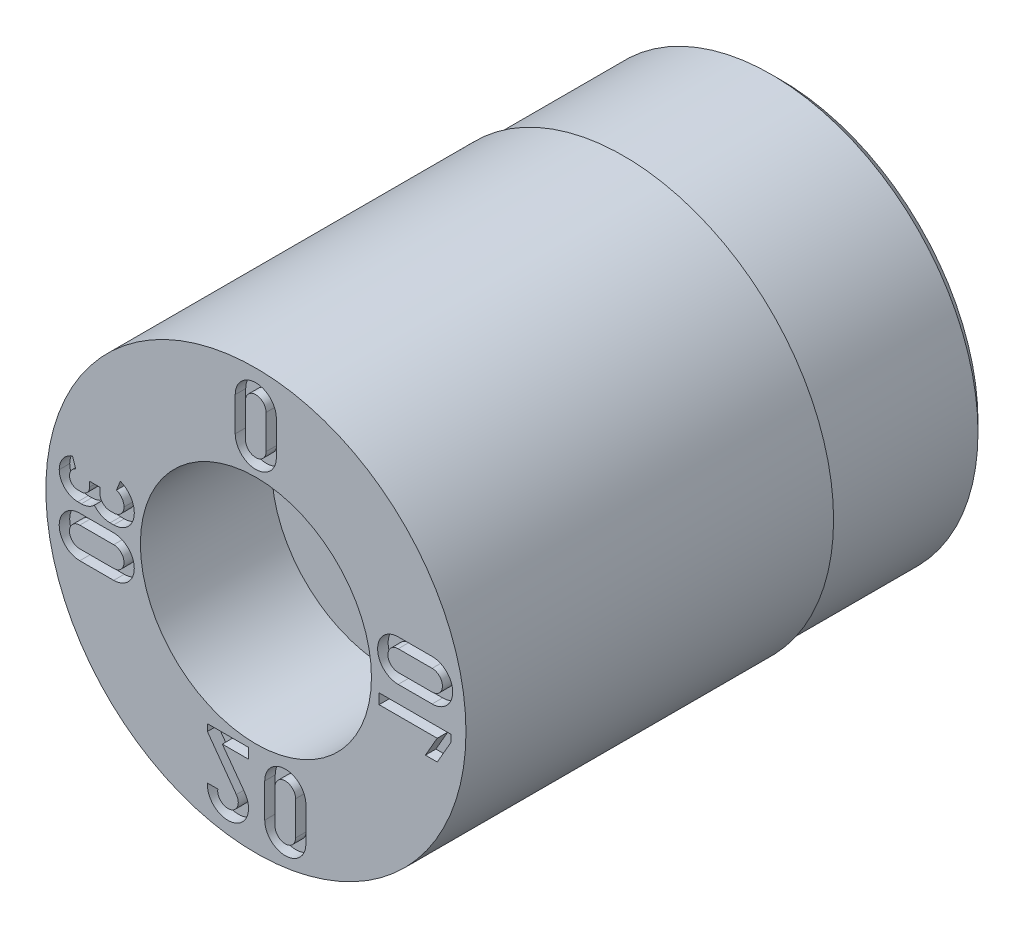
from build123d import *

# Parameters (mm, degrees)
SKETCH4_W          = 3
SKETCH4_H          = 1
CUT_EXTRUDE1_DEPTH = 0.2


with BuildPart() as part:
    # Sketch1 → Revolve1 (revolve)
    with BuildSketch(Plane(origin=(0, 0, 0), x_dir=(0, 0, -1), z_dir=(1, 0, 0)), mode=Mode.PRIVATE) as revolve1_sk:
        Polygon((0, 4), (0, 2.2), (2.5, 2.2), (2.5, 1.15), (10, 1.15), (10, 3.75), (9.75, 4), align=None)
    revolve(revolve1_sk.sketch.rotate(Axis((0, 0, 3.797909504), (0, 0, -1)), 90), axis=Axis((0, 0, 3.797909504), (0, 0, -1)))

    # Sketch4 → Cut-Revolve1 (revolve, cut)
    with BuildSketch(Plane(origin=(0, 0, 0), x_dir=(0, 0, -1), z_dir=(1, 0, 0)), mode=Mode.PRIVATE) as cut_revolve1_sk:
        with Locations((8.5, 4.435)):
            Rectangle(SKETCH4_W, SKETCH4_H)
    revolve(cut_revolve1_sk.sketch.rotate(Axis((0, 0, 0), (0, 0, -1)), 90), axis=Axis((0, 0, 0), (0, 0, -1)), mode=Mode.SUBTRACT)

    # Sketch2 → Cut-Extrude1 (cut)
    # profile 1 of 7: a face of its own
    with BuildSketch(Plane.XY):
        with BuildLine():
            Line((0.951558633, -3.371128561), (0.951613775, -2.724884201))
            ThreePointArc((0.951613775, -2.724884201), (0.559807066, -2.33310244), (0.168043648, -2.724927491))
            Line((0.168043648, -2.724927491), (0.168098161, -3.371194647))
            ThreePointArc((0.168098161, -3.371194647), (0.55986144, -3.76289184), (0.951558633, -3.371128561))
        make_face()
        with BuildLine():
            Line((0.363963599, -2.724910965), (0.364018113, -3.371178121))
            ThreePointArc((0.364018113, -3.371178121), (0.559844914, -3.566971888), (0.755638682, -3.371145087))
            Line((0.755638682, -3.371145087), (0.755693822, -2.724864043))
            ThreePointArc((0.755693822, -2.724864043), (0.55980525, -2.529022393), (0.363963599, -2.724910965))
        make_face(mode=Mode.SUBTRACT)
    # profile 2 of 7: a face of its own
    with BuildSketch(Plane.XY):
        with BuildLine():
            Line((-2.707308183, 0.255520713), (-2.775851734, 0.255526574))
            ThreePointArc((-2.775851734, 0.255526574), (-2.914289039, 0.312882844), (-2.971621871, 0.451329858))
            Line((-2.971621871, 0.451329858), (-2.971613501, 0.549231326))
            Line((-2.971613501, 0.549231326), (-3.167478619, 0.549248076))
            Line((-3.167478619, 0.549248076), (-3.16748699, 0.451370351))
            ThreePointArc((-3.16748699, 0.451370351), (-3.213380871, 0.340599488), (-3.324159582, 0.294724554))
            Line((-3.324159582, 0.294724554), (-3.392693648, 0.294730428))
            ThreePointArc((-3.392693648, 0.294730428), (-3.503425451, 0.340663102), (-3.549347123, 0.451399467))
            ThreePointArc((-3.549347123, 0.451399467), (-3.516330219, 0.55418223), (-3.429520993, 0.618358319))
            Line((-3.429520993, 0.618358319), (-3.49218059, 0.803922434))
            ThreePointArc((-3.49218059, 0.803922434), (-3.675359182, 0.668365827), (-3.745189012, 0.451446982))
            ThreePointArc((-3.745189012, 0.451446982), (-3.641981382, 0.202132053), (-3.392690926, 0.098865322))
            Line((-3.392690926, 0.098865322), (-3.324176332, 0.098859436))
            ThreePointArc((-3.324176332, 0.098859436), (-3.190377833, 0.125238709), (-3.076617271, 0.200448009))
            ThreePointArc((-3.076617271, 0.200448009), (-2.941904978, 0.096587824), (-2.775860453, 0.059661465))
            Line((-2.775860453, 0.059661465), (-2.7072918, 0.059655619))
            ThreePointArc((-2.7072918, 0.059655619), (-2.430353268, 0.174350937), (-2.31564925, 0.451285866))
            ThreePointArc((-2.31564925, 0.451285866), (-2.388596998, 0.688167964), (-2.582149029, 0.842997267))
            Line((-2.582149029, 0.842997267), (-2.654019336, 0.660880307))
            ThreePointArc((-2.654019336, 0.660880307), (-2.550473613, 0.578059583), (-2.511459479, 0.451335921))
            ThreePointArc((-2.511459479, 0.451335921), (-2.568829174, 0.312866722), (-2.707308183, 0.255520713))
        make_face()
    # profile 3 of 7: a face of its own
    with BuildSketch(Plane.XY):
        with BuildLine():
            Line((3.35566898, 0.9217068), (2.709417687, 0.921651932))
            ThreePointArc((2.709417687, 0.921651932), (2.31772071, 0.52989637), (2.70946834, 0.13819146))
            Line((2.70946834, 0.13819146), (3.355735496, 0.138246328))
            ThreePointArc((3.355735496, 0.138246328), (3.747432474, 0.530009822), (3.35566898, 0.9217068))
        make_face()
        with BuildLine():
            Line((2.709451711, 0.334056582), (3.355718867, 0.33411145))
            ThreePointArc((3.355718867, 0.33411145), (3.551567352, 0.529993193), (3.355685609, 0.725841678))
            Line((3.355685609, 0.725841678), (2.709404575, 0.725786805))
            ThreePointArc((2.709404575, 0.725786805), (2.513585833, 0.529898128), (2.709451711, 0.334056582))
        make_face(mode=Mode.SUBTRACT)
    # profile 4 of 7: a face of its own
    with BuildSketch(Plane.XY):
        Polygon((3.716667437, -0.182730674), (3.716678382, -0.311644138), (3.453023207, -0.770238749), (3.227164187, -0.770257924), (3.452277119, -0.378563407), (2.345847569, -0.378657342), (2.345830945, -0.182847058), align=None)
    # profile 5 of 7: a face of its own
    with BuildSketch(Plane.XY):
        with BuildLine():
            Line((-0.140181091, -2.521380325), (-0.140197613, -2.325512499))
            Line((-0.140197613, -2.325512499), (-0.923548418, -2.325578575))
            Line((-0.923548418, -2.325578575), (-0.923537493, -2.455095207))
            Line((-0.923537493, -2.455095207), (-0.372780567, -3.219591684))
            ThreePointArc((-0.372780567, -3.219591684), (-0.485748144, -3.52451017), (-0.725390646, -3.304718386))
            Line((-0.725390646, -3.304718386), (-0.922369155, -3.304739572))
            ThreePointArc((-0.922369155, -3.304739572), (-0.425301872, -3.711013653), (-0.213623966, -3.104938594))
            Line((-0.213623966, -3.104938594), (-0.639603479, -2.521422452))
            Line((-0.639603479, -2.521422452), (-0.140181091, -2.521380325))
        make_face()
    # profile 6 of 7: a face of its own
    with BuildSketch(Plane.XY):
        with BuildLine():
            Line((-0.394003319, 3.364501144), (-0.393948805, 2.718249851))
            ThreePointArc((-0.393948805, 2.718249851), (-0.00225969, 2.326584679), (0.389402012, 2.718277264))
            Line((0.389402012, 2.718277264), (0.389457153, 3.36456723))
            ThreePointArc((0.389457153, 3.36456723), (-0.002306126, 3.756264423), (-0.394003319, 3.364501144))
        make_face()
        with BuildLine():
            Line((0.193591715, 2.718283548), (0.193537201, 3.364550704))
            ThreePointArc((0.193537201, 3.364550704), (-0.0022896, 3.560344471), (-0.198083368, 3.36451767))
            Line((-0.198083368, 3.36451767), (-0.198138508, 2.718236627))
            ThreePointArc((-0.198138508, 2.718236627), (-0.002249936, 2.522394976), (0.193591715, 2.718283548))
        make_face(mode=Mode.SUBTRACT)
    # profile 7 of 7: a face of its own
    with BuildSketch(Plane.XY):
        with BuildLine():
            Line((-3.354033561, -0.071079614), (-2.707782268, -0.071134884))
            ThreePointArc((-2.707782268, -0.071134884), (-2.316077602, -0.46289069), (-2.707833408, -0.854595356))
            Line((-2.707833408, -0.854595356), (-3.354100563, -0.854540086))
            ThreePointArc((-3.354100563, -0.854540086), (-3.745797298, -0.462776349), (-3.354033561, -0.071079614))
        make_face()
        with BuildLine():
            Line((-2.707838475, -0.65878506), (-3.354083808, -0.658620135))
            ThreePointArc((-3.354083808, -0.658620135), (-3.549877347, -0.462793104), (-3.354050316, -0.266999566))
            Line((-3.354050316, -0.266999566), (-2.707769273, -0.266945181))
            ThreePointArc((-2.707769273, -0.266945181), (-2.511887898, -0.462899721), (-2.707838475, -0.65878506))
        make_face(mode=Mode.SUBTRACT)
    extrude(amount=-CUT_EXTRUDE1_DEPTH, mode=Mode.SUBTRACT)


solid = part.part
